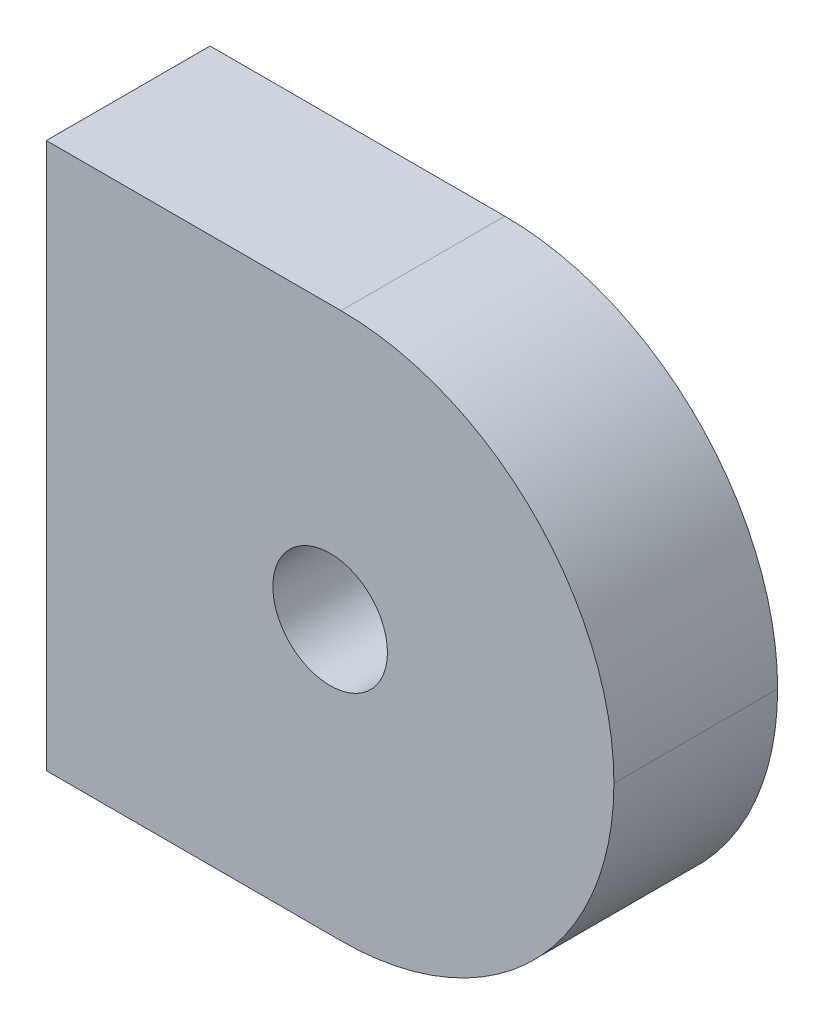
ISO-10303-21;
HEADER;
FILE_DESCRIPTION(('STEP AP214'),'2;1');
FILE_NAME('part.step','',(''),(''),'','','');
FILE_SCHEMA(('AUTOMOTIVE_DESIGN { 1 0 10303 214 1 1 1 1 }'));
ENDSEC;
DATA;
#1=APPLICATION_CONTEXT('core data for automotive mechanical design processes');
#2=APPLICATION_PROTOCOL_DEFINITION('international standard','automotive_design',2000,#1);
#3=PRODUCT_CONTEXT('',#1,'mechanical');
#4=PRODUCT('Part','Part','',(#3));
#5=PRODUCT_RELATED_PRODUCT_CATEGORY('part','',(#4));
#6=PRODUCT_DEFINITION_FORMATION('','',#4);
#7=PRODUCT_DEFINITION_CONTEXT('part definition',#1,'design');
#8=PRODUCT_DEFINITION('design','',#6,#7);
#9=PRODUCT_DEFINITION_SHAPE('','',#8);
#10=(LENGTH_UNIT() NAMED_UNIT(*) SI_UNIT(.MILLI.,.METRE.));
#11=(NAMED_UNIT(*) PLANE_ANGLE_UNIT() SI_UNIT($,.RADIAN.));
#12=(NAMED_UNIT(*) SI_UNIT($,.STERADIAN.) SOLID_ANGLE_UNIT());
#13=UNCERTAINTY_MEASURE_WITH_UNIT(LENGTH_MEASURE(1.E-05),#10,'distance_accuracy_value','');
#14=(GEOMETRIC_REPRESENTATION_CONTEXT(3) GLOBAL_UNCERTAINTY_ASSIGNED_CONTEXT((#13)) GLOBAL_UNIT_ASSIGNED_CONTEXT((#10,
#11,#12)) REPRESENTATION_CONTEXT('',''));
#15=CARTESIAN_POINT('',(0.,0.,0.));
#16=DIRECTION('',(0.,0.,1.));
#17=DIRECTION('',(1.,0.,0.));
#18=AXIS2_PLACEMENT_3D('',#15,#16,#17);
#19=CARTESIAN_POINT('',(-40.,30.,6.));
#20=DIRECTION('',(1.,0.,0.));
#21=DIRECTION('',(0.,1.,0.));
#22=AXIS2_PLACEMENT_3D('',#19,#20,#21);
#23=PLANE('',#22);
#24=DIRECTION('',(0.,-1.,0.));
#25=VECTOR('',#24,1.);
#26=CARTESIAN_POINT('',(-40.,30.,0.));
#27=LINE('',#26,#25);
#28=CARTESIAN_POINT('',(-40.,30.,0.));
#29=VERTEX_POINT('',#28);
#30=CARTESIAN_POINT('',(-40.,9.99999999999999,0.));
#31=VERTEX_POINT('',#30);
#32=EDGE_CURVE('E172',#29,#31,#27,.T.);
#33=ORIENTED_EDGE('',*,*,#32,.T.);
#34=DIRECTION('',(0.,0.,-1.));
#35=VECTOR('',#34,1.);
#36=CARTESIAN_POINT('',(-40.,9.99999999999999,6.));
#37=LINE('',#36,#35);
#38=CARTESIAN_POINT('',(-40.,9.99999999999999,6.));
#39=VERTEX_POINT('',#38);
#40=EDGE_CURVE('E191',#39,#31,#37,.T.);
#41=ORIENTED_EDGE('',*,*,#40,.F.);
#42=DIRECTION('',(0.,-1.,0.));
#43=VECTOR('',#42,1.);
#44=CARTESIAN_POINT('',(-40.,30.,6.));
#45=LINE('',#44,#43);
#46=CARTESIAN_POINT('',(-40.,30.,6.));
#47=VERTEX_POINT('',#46);
#48=EDGE_CURVE('E180',#47,#39,#45,.T.);
#49=ORIENTED_EDGE('',*,*,#48,.F.);
#50=DIRECTION('',(0.,0.,-1.));
#51=VECTOR('',#50,1.);
#52=CARTESIAN_POINT('',(-40.,30.,6.));
#53=LINE('',#52,#51);
#54=EDGE_CURVE('E188',#47,#29,#53,.T.);
#55=ORIENTED_EDGE('',*,*,#54,.T.);
#56=EDGE_LOOP('',(#33,#41,#49,#55));
#57=FACE_BOUND('',#56,.T.);
#58=ADVANCED_FACE('F27',(#57),#23,.F.);
#59=CARTESIAN_POINT('',(-40.,9.99999999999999,6.));
#60=DIRECTION('',(0.,1.,0.));
#61=DIRECTION('',(-1.,0.,0.));
#62=AXIS2_PLACEMENT_3D('',#59,#60,#61);
#63=PLANE('',#62);
#64=DIRECTION('',(1.,0.,0.));
#65=VECTOR('',#64,1.);
#66=CARTESIAN_POINT('',(-40.,9.99999999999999,0.));
#67=LINE('',#66,#65);
#68=CARTESIAN_POINT('',(-29.2,10.,0.));
#69=VERTEX_POINT('',#68);
#70=EDGE_CURVE('E175',#31,#69,#67,.T.);
#71=ORIENTED_EDGE('',*,*,#70,.T.);
#72=DIRECTION('',(0.,0.,-1.));
#73=VECTOR('',#72,1.);
#74=CARTESIAN_POINT('',(-29.2,10.,6.));
#75=LINE('',#74,#73);
#76=CARTESIAN_POINT('',(-29.2,10.,6.));
#77=VERTEX_POINT('',#76);
#78=EDGE_CURVE('E198',#69,#77,#75,.F.);
#79=ORIENTED_EDGE('',*,*,#78,.T.);
#80=DIRECTION('',(1.,0.,0.));
#81=VECTOR('',#80,1.);
#82=CARTESIAN_POINT('',(-40.,9.99999999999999,6.));
#83=LINE('',#82,#81);
#84=EDGE_CURVE('E183',#39,#77,#83,.T.);
#85=ORIENTED_EDGE('',*,*,#84,.F.);
#86=ORIENTED_EDGE('',*,*,#40,.T.);
#87=EDGE_LOOP('',(#71,#79,#85,#86));
#88=FACE_BOUND('',#87,.T.);
#89=ADVANCED_FACE('F215',(#88),#63,.F.);
#90=CARTESIAN_POINT('',(-40.,30.,6.));
#91=DIRECTION('',(0.,-1.,0.));
#92=DIRECTION('',(0.,0.,-1.));
#93=AXIS2_PLACEMENT_3D('',#90,#91,#92);
#94=PLANE('',#93);
#95=DIRECTION('',(-1.,0.,0.));
#96=VECTOR('',#95,1.);
#97=CARTESIAN_POINT('',(-40.,30.,6.));
#98=LINE('',#97,#96);
#99=CARTESIAN_POINT('',(-29.2,30.,6.));
#100=VERTEX_POINT('',#99);
#101=EDGE_CURVE('E186',#100,#47,#98,.T.);
#102=ORIENTED_EDGE('',*,*,#101,.F.);
#103=DIRECTION('',(0.,0.,-1.));
#104=VECTOR('',#103,1.);
#105=CARTESIAN_POINT('',(-29.2,30.,6.));
#106=LINE('',#105,#104);
#107=CARTESIAN_POINT('',(-29.2,30.,0.));
#108=VERTEX_POINT('',#107);
#109=EDGE_CURVE('E11',#100,#108,#106,.T.);
#110=ORIENTED_EDGE('',*,*,#109,.T.);
#111=DIRECTION('',(-1.,0.,0.));
#112=VECTOR('',#111,1.);
#113=CARTESIAN_POINT('',(-40.,30.,0.));
#114=LINE('',#113,#112);
#115=EDGE_CURVE('E178',#108,#29,#114,.T.);
#116=ORIENTED_EDGE('',*,*,#115,.T.);
#117=ORIENTED_EDGE('',*,*,#54,.F.);
#118=EDGE_LOOP('',(#102,#110,#116,#117));
#119=FACE_BOUND('',#118,.T.);
#120=ADVANCED_FACE('F221',(#119),#94,.F.);
#121=CARTESIAN_POINT('',(-40.,30.,6.));
#122=DIRECTION('',(0.,0.,1.));
#123=DIRECTION('',(1.,0.,0.));
#124=AXIS2_PLACEMENT_3D('',#121,#122,#123);
#125=PLANE('',#124);
#126=CARTESIAN_POINT('',(-29.6,20.,6.));
#127=DIRECTION('',(0.,0.,1.));
#128=DIRECTION('',(1.,0.,0.));
#129=AXIS2_PLACEMENT_3D('',#126,#127,#128);
#130=CIRCLE('',#129,2.1);
#131=CARTESIAN_POINT('',(-27.5,20.,6.));
#132=VERTEX_POINT('',#131);
#133=EDGE_CURVE('E169',#132,#132,#130,.T.);
#134=ORIENTED_EDGE('',*,*,#133,.F.);
#135=EDGE_LOOP('',(#134));
#136=FACE_BOUND('',#135,.T.);
#137=ORIENTED_EDGE('',*,*,#84,.T.);
#138=CARTESIAN_POINT('',(-29.2,20.,6.));
#139=DIRECTION('',(0.,0.,1.));
#140=DIRECTION('',(1.,0.,0.));
#141=AXIS2_PLACEMENT_3D('',#138,#139,#140);
#142=CIRCLE('',#141,10.);
#143=CARTESIAN_POINT('',(-19.2,20.,6.));
#144=VERTEX_POINT('',#143);
#145=EDGE_CURVE('E35',#77,#144,#142,.T.);
#146=ORIENTED_EDGE('',*,*,#145,.T.);
#147=CARTESIAN_POINT('',(-29.2,20.,6.));
#148=DIRECTION('',(0.,0.,1.));
#149=DIRECTION('',(1.,0.,0.));
#150=AXIS2_PLACEMENT_3D('',#147,#148,#149);
#151=CIRCLE('',#150,10.);
#152=EDGE_CURVE('E50',#144,#100,#151,.T.);
#153=ORIENTED_EDGE('',*,*,#152,.T.);
#154=ORIENTED_EDGE('',*,*,#101,.T.);
#155=ORIENTED_EDGE('',*,*,#48,.T.);
#156=EDGE_LOOP('',(#137,#146,#153,#154,#155));
#157=FACE_BOUND('',#156,.T.);
#158=ADVANCED_FACE('F202',(#136,#157),#125,.T.);
#159=CARTESIAN_POINT('',(-40.,30.,0.));
#160=DIRECTION('',(0.,0.,1.));
#161=DIRECTION('',(1.,0.,0.));
#162=AXIS2_PLACEMENT_3D('',#159,#160,#161);
#163=PLANE('',#162);
#164=DIRECTION('',(0.5,0.866025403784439,0.));
#165=VECTOR('',#164,1.);
#166=CARTESIAN_POINT('',(-33.3527767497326,20.,0.));
#167=LINE('',#166,#165);
#168=CARTESIAN_POINT('',(-33.3527767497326,20.,0.));
#169=VERTEX_POINT('',#168);
#170=CARTESIAN_POINT('',(-31.4763883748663,23.25,0.));
#171=VERTEX_POINT('',#170);
#172=EDGE_CURVE('E124',#169,#171,#167,.T.);
#173=ORIENTED_EDGE('',*,*,#172,.F.);
#174=DIRECTION('',(-0.500000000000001,0.866025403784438,0.));
#175=VECTOR('',#174,1.);
#176=CARTESIAN_POINT('',(-31.4763883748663,16.75,0.));
#177=LINE('',#176,#175);
#178=CARTESIAN_POINT('',(-31.4763883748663,16.75,0.));
#179=VERTEX_POINT('',#178);
#180=EDGE_CURVE('E42',#179,#169,#177,.T.);
#181=ORIENTED_EDGE('',*,*,#180,.F.);
#182=DIRECTION('',(-1.,0.,0.));
#183=VECTOR('',#182,1.);
#184=CARTESIAN_POINT('',(-27.7236116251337,16.75,0.));
#185=LINE('',#184,#183);
#186=CARTESIAN_POINT('',(-27.7236116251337,16.75,0.));
#187=VERTEX_POINT('',#186);
#188=EDGE_CURVE('E140',#187,#179,#185,.T.);
#189=ORIENTED_EDGE('',*,*,#188,.F.);
#190=DIRECTION('',(-0.500000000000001,-0.866025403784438,0.));
#191=VECTOR('',#190,1.);
#192=CARTESIAN_POINT('',(-25.8472232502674,20.,0.));
#193=LINE('',#192,#191);
#194=CARTESIAN_POINT('',(-25.8472232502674,20.,0.));
#195=VERTEX_POINT('',#194);
#196=EDGE_CURVE('E134',#195,#187,#193,.T.);
#197=ORIENTED_EDGE('',*,*,#196,.F.);
#198=DIRECTION('',(0.5,-0.866025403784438,0.));
#199=VECTOR('',#198,1.);
#200=CARTESIAN_POINT('',(-27.7236116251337,23.25,0.));
#201=LINE('',#200,#199);
#202=CARTESIAN_POINT('',(-27.7236116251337,23.25,0.));
#203=VERTEX_POINT('',#202);
#204=EDGE_CURVE('E132',#203,#195,#201,.T.);
#205=ORIENTED_EDGE('',*,*,#204,.F.);
#206=DIRECTION('',(1.,0.,0.));
#207=VECTOR('',#206,1.);
#208=CARTESIAN_POINT('',(-31.4763883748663,23.25,0.));
#209=LINE('',#208,#207);
#210=EDGE_CURVE('E113',#171,#203,#209,.T.);
#211=ORIENTED_EDGE('',*,*,#210,.F.);
#212=EDGE_LOOP('',(#173,#181,#189,#197,#205,#211));
#213=FACE_BOUND('',#212,.T.);
#214=CARTESIAN_POINT('',(-29.2,20.,0.));
#215=DIRECTION('',(0.,0.,1.));
#216=DIRECTION('',(1.,0.,0.));
#217=AXIS2_PLACEMENT_3D('',#214,#215,#216);
#218=CIRCLE('',#217,10.);
#219=CARTESIAN_POINT('',(-19.2,20.,0.));
#220=VERTEX_POINT('',#219);
#221=EDGE_CURVE('E194',#108,#220,#218,.F.);
#222=ORIENTED_EDGE('',*,*,#221,.T.);
#223=CARTESIAN_POINT('',(-29.2,20.,0.));
#224=DIRECTION('',(0.,0.,1.));
#225=DIRECTION('',(1.,0.,0.));
#226=AXIS2_PLACEMENT_3D('',#223,#224,#225);
#227=CIRCLE('',#226,10.);
#228=EDGE_CURVE('E196',#220,#69,#227,.F.);
#229=ORIENTED_EDGE('',*,*,#228,.T.);
#230=ORIENTED_EDGE('',*,*,#70,.F.);
#231=ORIENTED_EDGE('',*,*,#32,.F.);
#232=ORIENTED_EDGE('',*,*,#115,.F.);
#233=EDGE_LOOP('',(#222,#229,#230,#231,#232));
#234=FACE_BOUND('',#233,.T.);
#235=ADVANCED_FACE('F128',(#213,#234),#163,.F.);
#236=CARTESIAN_POINT('',(-29.6,20.,0.));
#237=DIRECTION('',(0.,0.,1.));
#238=DIRECTION('',(1.,0.,0.));
#239=AXIS2_PLACEMENT_3D('',#236,#237,#238);
#240=CYLINDRICAL_SURFACE('',#239,2.1);
#241=CARTESIAN_POINT('',(-29.6,20.,1.45));
#242=DIRECTION('',(0.,0.,1.));
#243=DIRECTION('',(1.,0.,0.));
#244=AXIS2_PLACEMENT_3D('',#241,#242,#243);
#245=CIRCLE('',#244,2.1);
#246=CARTESIAN_POINT('',(-27.5,20.,1.45));
#247=VERTEX_POINT('',#246);
#248=EDGE_CURVE('E30',#247,#247,#245,.F.);
#249=ORIENTED_EDGE('',*,*,#248,.T.);
#250=EDGE_LOOP('',(#249));
#251=FACE_BOUND('',#250,.T.);
#252=ORIENTED_EDGE('',*,*,#133,.T.);
#253=EDGE_LOOP('',(#252));
#254=FACE_BOUND('',#253,.T.);
#255=ADVANCED_FACE('F251',(#251,#254),#240,.F.);
#256=CARTESIAN_POINT('',(-29.2,20.,6.));
#257=DIRECTION('',(0.,0.,-1.));
#258=DIRECTION('',(-1.,0.,0.));
#259=AXIS2_PLACEMENT_3D('',#256,#257,#258);
#260=CYLINDRICAL_SURFACE('',#259,10.);
#261=ORIENTED_EDGE('',*,*,#109,.F.);
#262=ORIENTED_EDGE('',*,*,#152,.F.);
#263=DIRECTION('',(0.,0.,-1.));
#264=VECTOR('',#263,1.);
#265=CARTESIAN_POINT('',(-19.2,20.,6.));
#266=LINE('',#265,#264);
#267=EDGE_CURVE('E166',#220,#144,#266,.F.);
#268=ORIENTED_EDGE('',*,*,#267,.F.);
#269=ORIENTED_EDGE('',*,*,#221,.F.);
#270=EDGE_LOOP('',(#261,#262,#268,#269));
#271=FACE_BOUND('',#270,.T.);
#272=ADVANCED_FACE('F208',(#271),#260,.T.);
#273=CARTESIAN_POINT('',(-29.2,20.,6.));
#274=DIRECTION('',(0.,0.,-1.));
#275=DIRECTION('',(-1.,0.,0.));
#276=AXIS2_PLACEMENT_3D('',#273,#274,#275);
#277=CYLINDRICAL_SURFACE('',#276,10.);
#278=ORIENTED_EDGE('',*,*,#145,.F.);
#279=ORIENTED_EDGE('',*,*,#78,.F.);
#280=ORIENTED_EDGE('',*,*,#228,.F.);
#281=ORIENTED_EDGE('',*,*,#267,.T.);
#282=EDGE_LOOP('',(#278,#279,#280,#281));
#283=FACE_BOUND('',#282,.T.);
#284=ADVANCED_FACE('F211',(#283),#277,.T.);
#285=CARTESIAN_POINT('',(-29.6,13.5,1.45));
#286=DIRECTION('',(0.,0.,1.));
#287=DIRECTION('',(1.,0.,0.));
#288=AXIS2_PLACEMENT_3D('',#285,#286,#287);
#289=PLANE('',#288);
#290=DIRECTION('',(-0.500000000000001,0.866025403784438,0.));
#291=VECTOR('',#290,1.);
#292=CARTESIAN_POINT('',(-31.4763883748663,16.75,1.45));
#293=LINE('',#292,#291);
#294=CARTESIAN_POINT('',(-31.4763883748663,16.75,1.45));
#295=VERTEX_POINT('',#294);
#296=CARTESIAN_POINT('',(-33.3527767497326,20.,1.45));
#297=VERTEX_POINT('',#296);
#298=EDGE_CURVE('E143',#295,#297,#293,.T.);
#299=ORIENTED_EDGE('',*,*,#298,.T.);
#300=DIRECTION('',(0.5,0.866025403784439,0.));
#301=VECTOR('',#300,1.);
#302=CARTESIAN_POINT('',(-33.3527767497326,20.,1.45));
#303=LINE('',#302,#301);
#304=CARTESIAN_POINT('',(-31.4763883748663,23.25,1.45));
#305=VERTEX_POINT('',#304);
#306=EDGE_CURVE('E146',#297,#305,#303,.T.);
#307=ORIENTED_EDGE('',*,*,#306,.T.);
#308=DIRECTION('',(1.,0.,0.));
#309=VECTOR('',#308,1.);
#310=CARTESIAN_POINT('',(-31.4763883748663,23.25,1.45));
#311=LINE('',#310,#309);
#312=CARTESIAN_POINT('',(-27.7236116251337,23.25,1.45));
#313=VERTEX_POINT('',#312);
#314=EDGE_CURVE('E116',#305,#313,#311,.T.);
#315=ORIENTED_EDGE('',*,*,#314,.T.);
#316=DIRECTION('',(0.5,-0.866025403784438,0.));
#317=VECTOR('',#316,1.);
#318=CARTESIAN_POINT('',(-27.7236116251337,23.25,1.45));
#319=LINE('',#318,#317);
#320=CARTESIAN_POINT('',(-25.8472232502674,20.,1.45));
#321=VERTEX_POINT('',#320);
#322=EDGE_CURVE('E149',#313,#321,#319,.T.);
#323=ORIENTED_EDGE('',*,*,#322,.T.);
#324=DIRECTION('',(-0.500000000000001,-0.866025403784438,0.));
#325=VECTOR('',#324,1.);
#326=CARTESIAN_POINT('',(-25.8472232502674,20.,1.45));
#327=LINE('',#326,#325);
#328=CARTESIAN_POINT('',(-27.7236116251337,16.75,1.45));
#329=VERTEX_POINT('',#328);
#330=EDGE_CURVE('E152',#321,#329,#327,.T.);
#331=ORIENTED_EDGE('',*,*,#330,.T.);
#332=DIRECTION('',(-1.,0.,0.));
#333=VECTOR('',#332,1.);
#334=CARTESIAN_POINT('',(-27.7236116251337,16.75,1.45));
#335=LINE('',#334,#333);
#336=EDGE_CURVE('E155',#329,#295,#335,.T.);
#337=ORIENTED_EDGE('',*,*,#336,.T.);
#338=EDGE_LOOP('',(#299,#307,#315,#323,#331,#337));
#339=FACE_BOUND('',#338,.T.);
#340=ORIENTED_EDGE('',*,*,#248,.F.);
#341=EDGE_LOOP('',(#340));
#342=FACE_BOUND('',#341,.T.);
#343=ADVANCED_FACE('F271',(#339,#342),#289,.F.);
#344=CARTESIAN_POINT('',(-31.4763883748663,16.75,1.45));
#345=DIRECTION('',(-0.866025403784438,-0.500000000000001,0.));
#346=DIRECTION('',(0.500000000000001,-0.866025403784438,0.));
#347=AXIS2_PLACEMENT_3D('',#344,#345,#346);
#348=PLANE('',#347);
#349=ORIENTED_EDGE('',*,*,#180,.T.);
#350=DIRECTION('',(0.,0.,-1.));
#351=VECTOR('',#350,1.);
#352=CARTESIAN_POINT('',(-33.3527767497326,20.,1.45));
#353=LINE('',#352,#351);
#354=EDGE_CURVE('E121',#297,#169,#353,.T.);
#355=ORIENTED_EDGE('',*,*,#354,.F.);
#356=ORIENTED_EDGE('',*,*,#298,.F.);
#357=DIRECTION('',(0.,0.,-1.));
#358=VECTOR('',#357,1.);
#359=CARTESIAN_POINT('',(-31.4763883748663,16.75,1.45));
#360=LINE('',#359,#358);
#361=EDGE_CURVE('E158',#295,#179,#360,.T.);
#362=ORIENTED_EDGE('',*,*,#361,.T.);
#363=EDGE_LOOP('',(#349,#355,#356,#362));
#364=FACE_BOUND('',#363,.T.);
#365=ADVANCED_FACE('F277',(#364),#348,.F.);
#366=CARTESIAN_POINT('',(-27.7236116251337,16.75,1.45));
#367=DIRECTION('',(0.,-1.,0.));
#368=DIRECTION('',(0.,0.,-1.));
#369=AXIS2_PLACEMENT_3D('',#366,#367,#368);
#370=PLANE('',#369);
#371=ORIENTED_EDGE('',*,*,#188,.T.);
#372=ORIENTED_EDGE('',*,*,#361,.F.);
#373=ORIENTED_EDGE('',*,*,#336,.F.);
#374=DIRECTION('',(0.,0.,-1.));
#375=VECTOR('',#374,1.);
#376=CARTESIAN_POINT('',(-27.7236116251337,16.75,1.45));
#377=LINE('',#376,#375);
#378=EDGE_CURVE('E160',#329,#187,#377,.T.);
#379=ORIENTED_EDGE('',*,*,#378,.T.);
#380=EDGE_LOOP('',(#371,#372,#373,#379));
#381=FACE_BOUND('',#380,.T.);
#382=ADVANCED_FACE('F285',(#381),#370,.F.);
#383=CARTESIAN_POINT('',(-25.8472232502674,20.,1.45));
#384=DIRECTION('',(0.866025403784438,-0.500000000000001,0.));
#385=DIRECTION('',(0.500000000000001,0.866025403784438,0.));
#386=AXIS2_PLACEMENT_3D('',#383,#384,#385);
#387=PLANE('',#386);
#388=ORIENTED_EDGE('',*,*,#196,.T.);
#389=ORIENTED_EDGE('',*,*,#378,.F.);
#390=ORIENTED_EDGE('',*,*,#330,.F.);
#391=DIRECTION('',(0.,0.,-1.));
#392=VECTOR('',#391,1.);
#393=CARTESIAN_POINT('',(-25.8472232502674,20.,1.45));
#394=LINE('',#393,#392);
#395=EDGE_CURVE('E162',#321,#195,#394,.T.);
#396=ORIENTED_EDGE('',*,*,#395,.T.);
#397=EDGE_LOOP('',(#388,#389,#390,#396));
#398=FACE_BOUND('',#397,.T.);
#399=ADVANCED_FACE('F292',(#398),#387,.F.);
#400=CARTESIAN_POINT('',(-27.7236116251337,23.25,1.45));
#401=DIRECTION('',(0.866025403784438,0.5,0.));
#402=DIRECTION('',(-0.5,0.866025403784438,0.));
#403=AXIS2_PLACEMENT_3D('',#400,#401,#402);
#404=PLANE('',#403);
#405=ORIENTED_EDGE('',*,*,#204,.T.);
#406=ORIENTED_EDGE('',*,*,#395,.F.);
#407=ORIENTED_EDGE('',*,*,#322,.F.);
#408=DIRECTION('',(0.,0.,-1.));
#409=VECTOR('',#408,1.);
#410=CARTESIAN_POINT('',(-27.7236116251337,23.25,1.45));
#411=LINE('',#410,#409);
#412=EDGE_CURVE('E120',#313,#203,#411,.T.);
#413=ORIENTED_EDGE('',*,*,#412,.T.);
#414=EDGE_LOOP('',(#405,#406,#407,#413));
#415=FACE_BOUND('',#414,.T.);
#416=ADVANCED_FACE('F300',(#415),#404,.F.);
#417=CARTESIAN_POINT('',(-31.4763883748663,23.25,1.45));
#418=DIRECTION('',(0.,1.,0.));
#419=DIRECTION('',(0.,0.,1.));
#420=AXIS2_PLACEMENT_3D('',#417,#418,#419);
#421=PLANE('',#420);
#422=ORIENTED_EDGE('',*,*,#210,.T.);
#423=ORIENTED_EDGE('',*,*,#412,.F.);
#424=ORIENTED_EDGE('',*,*,#314,.F.);
#425=DIRECTION('',(0.,0.,-1.));
#426=VECTOR('',#425,1.);
#427=CARTESIAN_POINT('',(-31.4763883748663,23.25,1.45));
#428=LINE('',#427,#426);
#429=EDGE_CURVE('E109',#305,#171,#428,.T.);
#430=ORIENTED_EDGE('',*,*,#429,.T.);
#431=EDGE_LOOP('',(#422,#423,#424,#430));
#432=FACE_BOUND('',#431,.T.);
#433=ADVANCED_FACE('F111',(#432),#421,.F.);
#434=CARTESIAN_POINT('',(-33.3527767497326,20.,1.45));
#435=DIRECTION('',(-0.866025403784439,0.5,0.));
#436=DIRECTION('',(-0.5,-0.866025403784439,0.));
#437=AXIS2_PLACEMENT_3D('',#434,#435,#436);
#438=PLANE('',#437);
#439=ORIENTED_EDGE('',*,*,#172,.T.);
#440=ORIENTED_EDGE('',*,*,#429,.F.);
#441=ORIENTED_EDGE('',*,*,#306,.F.);
#442=ORIENTED_EDGE('',*,*,#354,.T.);
#443=EDGE_LOOP('',(#439,#440,#441,#442));
#444=FACE_BOUND('',#443,.T.);
#445=ADVANCED_FACE('F125',(#444),#438,.F.);
#446=CLOSED_SHELL('',(#58,#89,#120,#158,#235,#255,#272,#284,#343,#365,#382,#399,#416,#433,#445));
#447=MANIFOLD_SOLID_BREP('B2',#446);
#448=ADVANCED_BREP_SHAPE_REPRESENTATION('',(#18,#447),#14);
#449=SHAPE_DEFINITION_REPRESENTATION(#9,#448);
ENDSEC;
END-ISO-10303-21;
